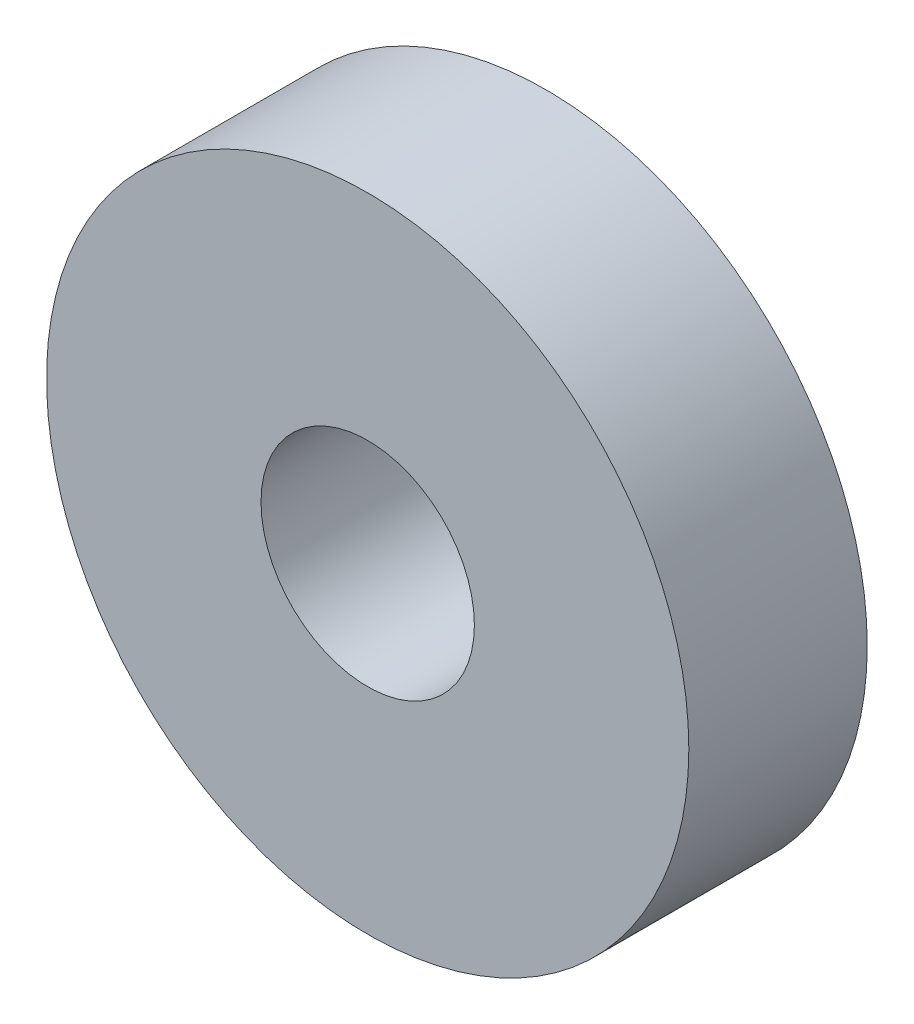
ISO-10303-21;
HEADER;
FILE_DESCRIPTION(('STEP AP214'),'2;1');
FILE_NAME('part.step','',(''),(''),'','','');
FILE_SCHEMA(('AUTOMOTIVE_DESIGN { 1 0 10303 214 1 1 1 1 }'));
ENDSEC;
DATA;
#1=APPLICATION_CONTEXT('core data for automotive mechanical design processes');
#2=APPLICATION_PROTOCOL_DEFINITION('international standard','automotive_design',2000,#1);
#3=PRODUCT_CONTEXT('',#1,'mechanical');
#4=PRODUCT('Part','Part','',(#3));
#5=PRODUCT_RELATED_PRODUCT_CATEGORY('part','',(#4));
#6=PRODUCT_DEFINITION_FORMATION('','',#4);
#7=PRODUCT_DEFINITION_CONTEXT('part definition',#1,'design');
#8=PRODUCT_DEFINITION('design','',#6,#7);
#9=PRODUCT_DEFINITION_SHAPE('','',#8);
#10=(LENGTH_UNIT() NAMED_UNIT(*) SI_UNIT(.MILLI.,.METRE.));
#11=(NAMED_UNIT(*) PLANE_ANGLE_UNIT() SI_UNIT($,.RADIAN.));
#12=(NAMED_UNIT(*) SI_UNIT($,.STERADIAN.) SOLID_ANGLE_UNIT());
#13=UNCERTAINTY_MEASURE_WITH_UNIT(LENGTH_MEASURE(1.E-05),#10,'distance_accuracy_value','');
#14=(GEOMETRIC_REPRESENTATION_CONTEXT(3) GLOBAL_UNCERTAINTY_ASSIGNED_CONTEXT((#13)) GLOBAL_UNIT_ASSIGNED_CONTEXT((#10,
#11,#12)) REPRESENTATION_CONTEXT('',''));
#15=CARTESIAN_POINT('',(0.,0.,0.));
#16=DIRECTION('',(0.,0.,1.));
#17=DIRECTION('',(1.,0.,0.));
#18=AXIS2_PLACEMENT_3D('',#15,#16,#17);
#19=CARTESIAN_POINT('',(0.,0.,3.175));
#20=DIRECTION('',(0.,0.,1.));
#21=DIRECTION('',(1.,0.,0.));
#22=AXIS2_PLACEMENT_3D('',#19,#20,#21);
#23=PLANE('',#22);
#24=CARTESIAN_POINT('',(0.,0.,3.175));
#25=DIRECTION('',(0.,0.,1.));
#26=DIRECTION('',(1.,0.,0.));
#27=AXIS2_PLACEMENT_3D('',#24,#25,#26);
#28=CIRCLE('',#27,5.715);
#29=CARTESIAN_POINT('',(5.715,0.,3.175));
#30=VERTEX_POINT('',#29);
#31=EDGE_CURVE('E10',#30,#30,#28,.T.);
#32=ORIENTED_EDGE('',*,*,#31,.T.);
#33=EDGE_LOOP('',(#32));
#34=FACE_BOUND('',#33,.T.);
#35=CARTESIAN_POINT('',(0.,0.,3.175));
#36=DIRECTION('',(0.,0.,1.));
#37=DIRECTION('',(1.,0.,0.));
#38=AXIS2_PLACEMENT_3D('',#35,#36,#37);
#39=CIRCLE('',#38,1.89865);
#40=CARTESIAN_POINT('',(1.89865,0.,3.175));
#41=VERTEX_POINT('',#40);
#42=EDGE_CURVE('E56',#41,#41,#39,.T.);
#43=ORIENTED_EDGE('',*,*,#42,.F.);
#44=EDGE_LOOP('',(#43));
#45=FACE_BOUND('',#44,.T.);
#46=ADVANCED_FACE('F43',(#34,#45),#23,.T.);
#47=CARTESIAN_POINT('',(0.,0.,0.));
#48=DIRECTION('',(0.,0.,1.));
#49=DIRECTION('',(1.,0.,0.));
#50=AXIS2_PLACEMENT_3D('',#47,#48,#49);
#51=PLANE('',#50);
#52=CARTESIAN_POINT('',(0.,0.,0.));
#53=DIRECTION('',(0.,0.,1.));
#54=DIRECTION('',(1.,0.,0.));
#55=AXIS2_PLACEMENT_3D('',#52,#53,#54);
#56=CIRCLE('',#55,5.715);
#57=CARTESIAN_POINT('',(5.715,0.,0.));
#58=VERTEX_POINT('',#57);
#59=EDGE_CURVE('E47',#58,#58,#56,.T.);
#60=ORIENTED_EDGE('',*,*,#59,.F.);
#61=EDGE_LOOP('',(#60));
#62=FACE_BOUND('',#61,.T.);
#63=CARTESIAN_POINT('',(0.,0.,0.));
#64=DIRECTION('',(0.,0.,1.));
#65=DIRECTION('',(1.,0.,0.));
#66=AXIS2_PLACEMENT_3D('',#63,#64,#65);
#67=CIRCLE('',#66,1.89865);
#68=CARTESIAN_POINT('',(1.89865,0.,0.));
#69=VERTEX_POINT('',#68);
#70=EDGE_CURVE('E58',#69,#69,#67,.T.);
#71=ORIENTED_EDGE('',*,*,#70,.T.);
#72=EDGE_LOOP('',(#71));
#73=FACE_BOUND('',#72,.T.);
#74=ADVANCED_FACE('F70',(#62,#73),#51,.F.);
#75=CARTESIAN_POINT('',(0.,0.,3.175));
#76=DIRECTION('',(0.,0.,-1.));
#77=DIRECTION('',(-1.,0.,0.));
#78=AXIS2_PLACEMENT_3D('',#75,#76,#77);
#79=CYLINDRICAL_SURFACE('',#78,5.715);
#80=ORIENTED_EDGE('',*,*,#31,.F.);
#81=EDGE_LOOP('',(#80));
#82=FACE_BOUND('',#81,.T.);
#83=ORIENTED_EDGE('',*,*,#59,.T.);
#84=EDGE_LOOP('',(#83));
#85=FACE_BOUND('',#84,.T.);
#86=ADVANCED_FACE('F45',(#82,#85),#79,.T.);
#87=CARTESIAN_POINT('',(0.,0.,3.175));
#88=DIRECTION('',(0.,0.,-1.));
#89=DIRECTION('',(-1.,0.,0.));
#90=AXIS2_PLACEMENT_3D('',#87,#88,#89);
#91=CYLINDRICAL_SURFACE('',#90,1.89865);
#92=ORIENTED_EDGE('',*,*,#42,.T.);
#93=EDGE_LOOP('',(#92));
#94=FACE_BOUND('',#93,.T.);
#95=ORIENTED_EDGE('',*,*,#70,.F.);
#96=EDGE_LOOP('',(#95));
#97=FACE_BOUND('',#96,.T.);
#98=ADVANCED_FACE('F66',(#94,#97),#91,.F.);
#99=CLOSED_SHELL('',(#46,#74,#86,#98));
#100=MANIFOLD_SOLID_BREP('B2',#99);
#101=ADVANCED_BREP_SHAPE_REPRESENTATION('',(#18,#100),#14);
#102=SHAPE_DEFINITION_REPRESENTATION(#9,#101);
ENDSEC;
END-ISO-10303-21;
